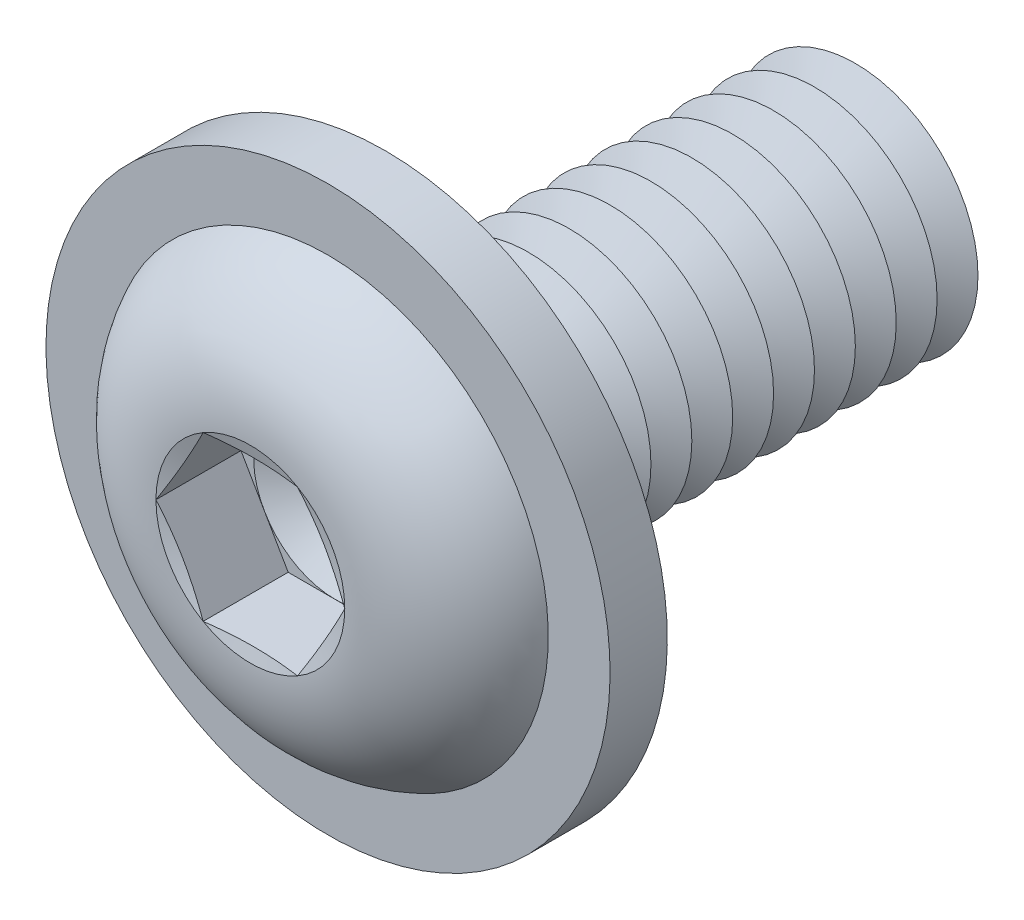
from build123d import *

# Parameters (mm, degrees)
FILLET1_R           = 0.25
LPATTERN1_COUNT     = 12
LPATTERN1_PITCH     = 0.5
CUT_EXTRUDE1_DEPTH  = 1.04
SKETCH5_R           = 3.45
SKETCH5_R_2         = 1.75
BOSS_EXTRUDE1_DEPTH = 0.7


with BuildPart() as part:
    # Sketch1 → Revolve1 (revolve)
    with BuildSketch(Plane(origin=(0, 0, 0), x_dir=(0, 0, -1), z_dir=(1, 0, 0)), mode=Mode.PRIVATE) as revolve1_sk:
        with BuildLine():
            Line((0, 1.5), (0, 2.85))
            ThreePointArc((0, 2.85), (-1.182850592, 2.35063849), (-1.65, 1.1547))
            Line((-1.65, 1.1547), (-1.495299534, 0.57735))
            Line((-1.495299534, 0.57735), (-1.65, 0.57735))
            Line((-1.65, 0.57735), (-1.65, 0))
            Line((-1.65, 0), (6, 0))
            Line((6, 0), (6, 1.5))
            Line((6, 1.5), (0, 1.5))
        make_face()
    revolve(revolve1_sk.sketch.rotate(Axis((0, 0, -6), (0, 0, 1)), 90), axis=Axis((0, 0, -6), (0, 0, 1)))

    # Fillet1
    fillet1_edges = [part.edges().sort_by_distance(p)[0] for p in [
        (1.5, 0, 0),
    ]]
    fillet(fillet1_edges, radius=FILLET1_R)

    # Sketch2 → Cut-Revolve1 (revolve, cut)
    with BuildSketch(Plane(origin=(0, 0, 0), x_dir=(0, 0, -1), z_dir=(1, 0, 0)), mode=Mode.PRIVATE) as cut_revolve1_sk:
        Polygon((5.75, 1.5), (6.25, 1.5), (6, 1.066987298), align=None)
    cut_revolve1 = revolve(cut_revolve1_sk.sketch.rotate(Axis((0, 0, -6), (0, 0, -1)), 270), axis=Axis((0, 0, -6), (0, 0, -1)), mode=Mode.SUBTRACT)

    # LPattern1: Cut-Revolve1 ×12
    with Locations(*[(0, 0, i * LPATTERN1_PITCH) for i in range(1, LPATTERN1_COUNT)]):
        add(cut_revolve1, mode=Mode.SUBTRACT)

    # Sketch3 → Cut-Extrude1 (cut)
    with BuildSketch(Plane.XY.offset(1.65)):
        Polygon((0.57735, 0.999999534), (-0.57735, 0.999999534), (-1.1547, 0), (-0.57735, -0.999999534), (0.57735, -0.999999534), (1.1547, 0), align=None)
    extrude(amount=-CUT_EXTRUDE1_DEPTH, mode=Mode.SUBTRACT)

    # Cut-Extrude2 cone 1 section (on through the dimple's axis) → Cut-Extrude2 (revolve, cut)
    with BuildSketch(Plane(origin=(0, 0, 0.61), x_dir=(0, -1, 0), z_dir=(1, 0, 0))):
        Polygon((0, 0), (0.999999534, 0), (0, 0.57735), align=None)
    revolve(axis=Axis((0, 0, 0.61), (0, 0, -1)), mode=Mode.SUBTRACT)

    # Sketch5 → Boss-Extrude1 (add)
    with BuildSketch(Plane(origin=(0, 0, 0), x_dir=(-1, 0, 0), z_dir=(0, 0, -1))):
        with Locations(Location((0, 0, 0), (0, 0, 90))):
            Circle(SKETCH5_R)
        Circle(SKETCH5_R_2, mode=Mode.SUBTRACT)
    extrude(amount=-BOSS_EXTRUDE1_DEPTH)


solid = part.part
